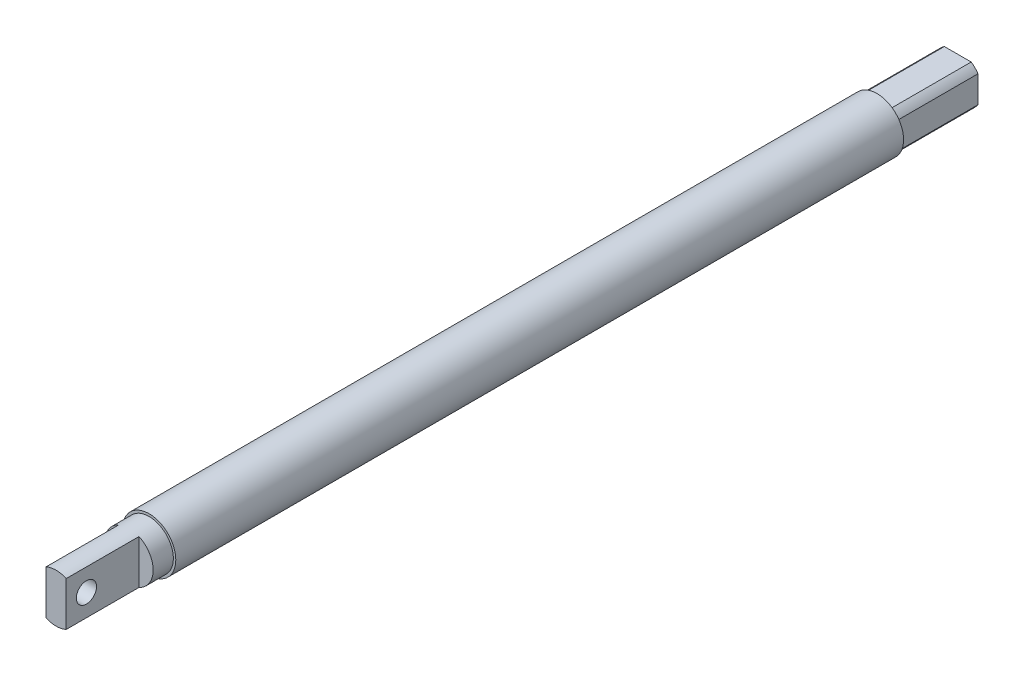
ISO-10303-21;
HEADER;
FILE_DESCRIPTION(('STEP AP214'),'2;1');
FILE_NAME('part.step','',(''),(''),'','','');
FILE_SCHEMA(('AUTOMOTIVE_DESIGN { 1 0 10303 214 1 1 1 1 }'));
ENDSEC;
DATA;
#1=APPLICATION_CONTEXT('core data for automotive mechanical design processes');
#2=APPLICATION_PROTOCOL_DEFINITION('international standard','automotive_design',2000,#1);
#3=PRODUCT_CONTEXT('',#1,'mechanical');
#4=PRODUCT('Part','Part','',(#3));
#5=PRODUCT_RELATED_PRODUCT_CATEGORY('part','',(#4));
#6=PRODUCT_DEFINITION_FORMATION('','',#4);
#7=PRODUCT_DEFINITION_CONTEXT('part definition',#1,'design');
#8=PRODUCT_DEFINITION('design','',#6,#7);
#9=PRODUCT_DEFINITION_SHAPE('','',#8);
#10=(LENGTH_UNIT() NAMED_UNIT(*) SI_UNIT(.MILLI.,.METRE.));
#11=(NAMED_UNIT(*) PLANE_ANGLE_UNIT() SI_UNIT($,.RADIAN.));
#12=(NAMED_UNIT(*) SI_UNIT($,.STERADIAN.) SOLID_ANGLE_UNIT());
#13=UNCERTAINTY_MEASURE_WITH_UNIT(LENGTH_MEASURE(1.E-05),#10,'distance_accuracy_value','');
#14=(GEOMETRIC_REPRESENTATION_CONTEXT(3) GLOBAL_UNCERTAINTY_ASSIGNED_CONTEXT((#13)) GLOBAL_UNIT_ASSIGNED_CONTEXT((#10,
#11,#12)) REPRESENTATION_CONTEXT('',''));
#15=CARTESIAN_POINT('',(0.,0.,0.));
#16=DIRECTION('',(0.,0.,1.));
#17=DIRECTION('',(1.,0.,0.));
#18=AXIS2_PLACEMENT_3D('',#15,#16,#17);
#19=CARTESIAN_POINT('',(0.,0.,254.));
#20=DIRECTION('',(0.,0.,-1.));
#21=DIRECTION('',(-1.,0.,0.));
#22=AXIS2_PLACEMENT_3D('',#19,#20,#21);
#23=CYLINDRICAL_SURFACE('',#22,6.985);
#24=CARTESIAN_POINT('',(0.,0.,25.4));
#25=DIRECTION('',(0.,0.,1.));
#26=DIRECTION('',(1.,0.,0.));
#27=AXIS2_PLACEMENT_3D('',#24,#25,#26);
#28=CIRCLE('',#27,6.985);
#29=CARTESIAN_POINT('',(0.,6.985,25.4));
#30=VERTEX_POINT('',#29);
#31=CARTESIAN_POINT('',(-2.90993556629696,6.35,25.4));
#32=VERTEX_POINT('',#31);
#33=EDGE_CURVE('E219',#30,#32,#28,.T.);
#34=ORIENTED_EDGE('',*,*,#33,.F.);
#35=DIRECTION('',(0.,0.,-1.));
#36=VECTOR('',#35,1.);
#37=CARTESIAN_POINT('',(0.,6.985,254.));
#38=LINE('',#37,#36);
#39=CARTESIAN_POINT('',(0.,6.985,254.));
#40=VERTEX_POINT('',#39);
#41=EDGE_CURVE('E12',#30,#40,#38,.F.);
#42=ORIENTED_EDGE('',*,*,#41,.T.);
#43=CARTESIAN_POINT('',(0.,0.,254.));
#44=DIRECTION('',(0.,0.,1.));
#45=DIRECTION('',(1.,0.,0.));
#46=AXIS2_PLACEMENT_3D('',#43,#44,#45);
#47=CIRCLE('',#46,6.985);
#48=CARTESIAN_POINT('',(6.985,0.,254.));
#49=VERTEX_POINT('',#48);
#50=EDGE_CURVE('E208',#40,#49,#47,.T.);
#51=ORIENTED_EDGE('',*,*,#50,.T.);
#52=DIRECTION('',(0.,0.,-1.));
#53=VECTOR('',#52,1.);
#54=CARTESIAN_POINT('',(6.985,0.,254.));
#55=LINE('',#54,#53);
#56=CARTESIAN_POINT('',(6.985,0.,25.4));
#57=VERTEX_POINT('',#56);
#58=EDGE_CURVE('E45',#49,#57,#55,.T.);
#59=ORIENTED_EDGE('',*,*,#58,.T.);
#60=CARTESIAN_POINT('',(6.35,-2.90993556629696,25.4));
#61=VERTEX_POINT('',#60);
#62=EDGE_CURVE('E379',#61,#57,#28,.T.);
#63=ORIENTED_EDGE('',*,*,#62,.F.);
#64=CARTESIAN_POINT('',(2.90993556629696,-6.35,25.4));
#65=VERTEX_POINT('',#64);
#66=EDGE_CURVE('E220',#65,#61,#28,.T.);
#67=ORIENTED_EDGE('',*,*,#66,.F.);
#68=CARTESIAN_POINT('',(-2.90993556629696,-6.35,25.4));
#69=VERTEX_POINT('',#68);
#70=EDGE_CURVE('E377',#69,#65,#28,.T.);
#71=ORIENTED_EDGE('',*,*,#70,.F.);
#72=CARTESIAN_POINT('',(-6.35,-2.90993556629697,25.4));
#73=VERTEX_POINT('',#72);
#74=EDGE_CURVE('E375',#73,#69,#28,.T.);
#75=ORIENTED_EDGE('',*,*,#74,.F.);
#76=CARTESIAN_POINT('',(-6.35,2.90993556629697,25.4));
#77=VERTEX_POINT('',#76);
#78=EDGE_CURVE('E373',#77,#73,#28,.T.);
#79=ORIENTED_EDGE('',*,*,#78,.F.);
#80=EDGE_CURVE('E307',#32,#77,#28,.T.);
#81=ORIENTED_EDGE('',*,*,#80,.F.);
#82=EDGE_LOOP('',(#34,#42,#51,#59,#63,#67,#71,#75,#79,#81));
#83=FACE_BOUND('',#82,.T.);
#84=ADVANCED_FACE('F35',(#83),#23,.F.);
#85=CARTESIAN_POINT('',(0.,0.,25.4));
#86=DIRECTION('',(0.,0.,-1.));
#87=DIRECTION('',(-1.,0.,0.));
#88=AXIS2_PLACEMENT_3D('',#85,#86,#87);
#89=CYLINDRICAL_SURFACE('',#88,3.175);
#90=CARTESIAN_POINT('',(0.,0.,0.));
#91=DIRECTION('',(0.,0.,1.));
#92=DIRECTION('',(1.,0.,0.));
#93=AXIS2_PLACEMENT_3D('',#90,#91,#92);
#94=CIRCLE('',#93,3.175);
#95=CARTESIAN_POINT('',(0.,3.175,0.));
#96=VERTEX_POINT('',#95);
#97=CARTESIAN_POINT('',(3.175,0.,0.));
#98=VERTEX_POINT('',#97);
#99=EDGE_CURVE('E224',#96,#98,#94,.T.);
#100=ORIENTED_EDGE('',*,*,#99,.F.);
#101=DIRECTION('',(0.,0.,-1.));
#102=VECTOR('',#101,1.);
#103=CARTESIAN_POINT('',(0.,3.175,25.4));
#104=LINE('',#103,#102);
#105=CARTESIAN_POINT('',(0.,3.175,25.4));
#106=VERTEX_POINT('',#105);
#107=EDGE_CURVE('E314',#96,#106,#104,.F.);
#108=ORIENTED_EDGE('',*,*,#107,.T.);
#109=CARTESIAN_POINT('',(0.,0.,25.4));
#110=DIRECTION('',(0.,0.,1.));
#111=DIRECTION('',(1.,0.,0.));
#112=AXIS2_PLACEMENT_3D('',#109,#110,#111);
#113=CIRCLE('',#112,3.175);
#114=CARTESIAN_POINT('',(3.175,0.,25.4));
#115=VERTEX_POINT('',#114);
#116=EDGE_CURVE('E231',#106,#115,#113,.T.);
#117=ORIENTED_EDGE('',*,*,#116,.T.);
#118=DIRECTION('',(0.,0.,-1.));
#119=VECTOR('',#118,1.);
#120=CARTESIAN_POINT('',(3.175,0.,25.4));
#121=LINE('',#120,#119);
#122=EDGE_CURVE('E39',#115,#98,#121,.T.);
#123=ORIENTED_EDGE('',*,*,#122,.T.);
#124=EDGE_LOOP('',(#100,#108,#117,#123));
#125=FACE_BOUND('',#124,.T.);
#126=ADVANCED_FACE('F330',(#125),#89,.F.);
#127=CARTESIAN_POINT('',(0.,0.,283.21));
#128=DIRECTION('',(0.,0.,-1.));
#129=DIRECTION('',(-1.,0.,0.));
#130=AXIS2_PLACEMENT_3D('',#127,#128,#129);
#131=CYLINDRICAL_SURFACE('',#130,7.62);
#132=CARTESIAN_POINT('',(0.,0.,254.));
#133=DIRECTION('',(0.,0.,1.));
#134=DIRECTION('',(1.,0.,0.));
#135=AXIS2_PLACEMENT_3D('',#132,#133,#134);
#136=CIRCLE('',#135,7.62);
#137=CARTESIAN_POINT('',(7.62,0.,254.));
#138=VERTEX_POINT('',#137);
#139=EDGE_CURVE('E204',#138,#138,#136,.T.);
#140=ORIENTED_EDGE('',*,*,#139,.T.);
#141=EDGE_LOOP('',(#140));
#142=FACE_BOUND('',#141,.T.);
#143=DIRECTION('',(0.,0.,-1.));
#144=VECTOR('',#143,1.);
#145=CARTESIAN_POINT('',(-3.17500000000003,6.92703219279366,283.21));
#146=LINE('',#145,#144);
#147=CARTESIAN_POINT('',(-3.17500000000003,6.92703219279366,283.21));
#148=VERTEX_POINT('',#147);
#149=CARTESIAN_POINT('',(-3.17500000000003,6.92703219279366,260.35));
#150=VERTEX_POINT('',#149);
#151=EDGE_CURVE('E185',#148,#150,#146,.T.);
#152=ORIENTED_EDGE('',*,*,#151,.F.);
#153=CARTESIAN_POINT('',(0.,0.,283.21));
#154=DIRECTION('',(0.,0.,1.));
#155=DIRECTION('',(1.,0.,0.));
#156=AXIS2_PLACEMENT_3D('',#153,#154,#155);
#157=CIRCLE('',#156,7.62);
#158=CARTESIAN_POINT('',(3.17500000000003,6.92703219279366,283.21));
#159=VERTEX_POINT('',#158);
#160=EDGE_CURVE('E205',#159,#148,#157,.T.);
#161=ORIENTED_EDGE('',*,*,#160,.F.);
#162=DIRECTION('',(0.,0.,-1.));
#163=VECTOR('',#162,1.);
#164=CARTESIAN_POINT('',(3.17500000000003,6.92703219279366,283.21));
#165=LINE('',#164,#163);
#166=CARTESIAN_POINT('',(3.17500000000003,6.92703219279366,260.35));
#167=VERTEX_POINT('',#166);
#168=EDGE_CURVE('E201',#159,#167,#165,.T.);
#169=ORIENTED_EDGE('',*,*,#168,.T.);
#170=CARTESIAN_POINT('',(0.,0.,260.35));
#171=DIRECTION('',(0.,0.,-1.));
#172=DIRECTION('',(-1.,0.,0.));
#173=AXIS2_PLACEMENT_3D('',#170,#171,#172);
#174=CIRCLE('',#173,7.62);
#175=CARTESIAN_POINT('',(3.17500000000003,-6.92703219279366,260.35));
#176=VERTEX_POINT('',#175);
#177=EDGE_CURVE('E306',#167,#176,#174,.T.);
#178=ORIENTED_EDGE('',*,*,#177,.T.);
#179=DIRECTION('',(0.,0.,-1.));
#180=VECTOR('',#179,1.);
#181=CARTESIAN_POINT('',(3.17500000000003,-6.92703219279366,283.21));
#182=LINE('',#181,#180);
#183=CARTESIAN_POINT('',(3.17500000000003,-6.92703219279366,283.21));
#184=VERTEX_POINT('',#183);
#185=EDGE_CURVE('E199',#176,#184,#182,.F.);
#186=ORIENTED_EDGE('',*,*,#185,.T.);
#187=CARTESIAN_POINT('',(-3.17500000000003,-6.92703219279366,283.21));
#188=VERTEX_POINT('',#187);
#189=EDGE_CURVE('E191',#188,#184,#157,.T.);
#190=ORIENTED_EDGE('',*,*,#189,.F.);
#191=DIRECTION('',(0.,0.,-1.));
#192=VECTOR('',#191,1.);
#193=CARTESIAN_POINT('',(-3.17500000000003,-6.92703219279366,283.21));
#194=LINE('',#193,#192);
#195=CARTESIAN_POINT('',(-3.17500000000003,-6.92703219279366,260.35));
#196=VERTEX_POINT('',#195);
#197=EDGE_CURVE('E183',#196,#188,#194,.F.);
#198=ORIENTED_EDGE('',*,*,#197,.F.);
#199=CARTESIAN_POINT('',(0.,0.,260.35));
#200=DIRECTION('',(0.,0.,1.));
#201=DIRECTION('',(1.,0.,0.));
#202=AXIS2_PLACEMENT_3D('',#199,#200,#201);
#203=CIRCLE('',#202,7.62);
#204=EDGE_CURVE('E172',#150,#196,#203,.T.);
#205=ORIENTED_EDGE('',*,*,#204,.F.);
#206=EDGE_LOOP('',(#152,#161,#169,#178,#186,#190,#198,#205));
#207=FACE_BOUND('',#206,.T.);
#208=ADVANCED_FACE('F189',(#142,#207),#131,.T.);
#209=CARTESIAN_POINT('',(0.,0.,283.21));
#210=DIRECTION('',(0.,0.,1.));
#211=DIRECTION('',(1.,0.,0.));
#212=AXIS2_PLACEMENT_3D('',#209,#210,#211);
#213=PLANE('',#212);
#214=ORIENTED_EDGE('',*,*,#160,.T.);
#215=DIRECTION('',(0.,-1.,0.));
#216=VECTOR('',#215,1.);
#217=CARTESIAN_POINT('',(-3.17500000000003,0.,283.21));
#218=LINE('',#217,#216);
#219=EDGE_CURVE('E179',#148,#188,#218,.T.);
#220=ORIENTED_EDGE('',*,*,#219,.T.);
#221=ORIENTED_EDGE('',*,*,#189,.T.);
#222=DIRECTION('',(0.,-1.,0.));
#223=VECTOR('',#222,1.);
#224=CARTESIAN_POINT('',(3.17500000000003,0.,283.21));
#225=LINE('',#224,#223);
#226=EDGE_CURVE('E303',#159,#184,#225,.T.);
#227=ORIENTED_EDGE('',*,*,#226,.F.);
#228=EDGE_LOOP('',(#214,#220,#221,#227));
#229=FACE_BOUND('',#228,.T.);
#230=ADVANCED_FACE('F596',(#229),#213,.T.);
#231=CARTESIAN_POINT('',(0.,0.,254.));
#232=DIRECTION('',(0.,0.,1.));
#233=DIRECTION('',(1.,0.,0.));
#234=AXIS2_PLACEMENT_3D('',#231,#232,#233);
#235=PLANE('',#234);
#236=CARTESIAN_POINT('',(0.,0.,254.));
#237=DIRECTION('',(0.,0.,1.));
#238=DIRECTION('',(1.,0.,0.));
#239=AXIS2_PLACEMENT_3D('',#236,#237,#238);
#240=CIRCLE('',#239,8.382);
#241=CARTESIAN_POINT('',(8.382,0.,254.));
#242=VERTEX_POINT('',#241);
#243=EDGE_CURVE('E221',#242,#242,#240,.T.);
#244=ORIENTED_EDGE('',*,*,#243,.T.);
#245=EDGE_LOOP('',(#244));
#246=FACE_BOUND('',#245,.T.);
#247=ORIENTED_EDGE('',*,*,#139,.F.);
#248=EDGE_LOOP('',(#247));
#249=FACE_BOUND('',#248,.T.);
#250=ADVANCED_FACE('F342',(#246,#249),#235,.T.);
#251=CARTESIAN_POINT('',(0.,0.,25.4));
#252=DIRECTION('',(0.,0.,1.));
#253=DIRECTION('',(1.,0.,0.));
#254=AXIS2_PLACEMENT_3D('',#251,#252,#253);
#255=PLANE('',#254);
#256=EDGE_CURVE('E227',#115,#106,#113,.T.);
#257=ORIENTED_EDGE('',*,*,#256,.F.);
#258=ORIENTED_EDGE('',*,*,#116,.F.);
#259=EDGE_LOOP('',(#257,#258));
#260=FACE_BOUND('',#259,.T.);
#261=DIRECTION('',(0.,1.,0.));
#262=VECTOR('',#261,1.);
#263=CARTESIAN_POINT('',(6.35,4.21211348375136,25.4));
#264=LINE('',#263,#262);
#265=CARTESIAN_POINT('',(6.35,2.90993556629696,25.4));
#266=VERTEX_POINT('',#265);
#267=EDGE_CURVE('E250',#61,#266,#264,.T.);
#268=ORIENTED_EDGE('',*,*,#267,.T.);
#269=CARTESIAN_POINT('',(2.90993556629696,6.35,25.4));
#270=VERTEX_POINT('',#269);
#271=EDGE_CURVE('E214',#266,#270,#28,.T.);
#272=ORIENTED_EDGE('',*,*,#271,.T.);
#273=DIRECTION('',(-1.,0.,0.));
#274=VECTOR('',#273,1.);
#275=CARTESIAN_POINT('',(-4.21211348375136,6.35,25.4));
#276=LINE('',#275,#274);
#277=EDGE_CURVE('E257',#270,#32,#276,.T.);
#278=ORIENTED_EDGE('',*,*,#277,.T.);
#279=ORIENTED_EDGE('',*,*,#80,.T.);
#280=DIRECTION('',(0.,-1.,0.));
#281=VECTOR('',#280,1.);
#282=CARTESIAN_POINT('',(-6.35,4.21211348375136,25.4));
#283=LINE('',#282,#281);
#284=EDGE_CURVE('E264',#77,#73,#283,.T.);
#285=ORIENTED_EDGE('',*,*,#284,.T.);
#286=ORIENTED_EDGE('',*,*,#74,.T.);
#287=DIRECTION('',(1.,0.,0.));
#288=VECTOR('',#287,1.);
#289=CARTESIAN_POINT('',(-4.21211348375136,-6.35,25.4));
#290=LINE('',#289,#288);
#291=EDGE_CURVE('E243',#69,#65,#290,.T.);
#292=ORIENTED_EDGE('',*,*,#291,.T.);
#293=ORIENTED_EDGE('',*,*,#66,.T.);
#294=EDGE_LOOP('',(#268,#272,#278,#279,#285,#286,#292,#293));
#295=FACE_BOUND('',#294,.T.);
#296=ADVANCED_FACE('F339',(#260,#295),#255,.T.);
#297=CARTESIAN_POINT('',(0.,0.,0.));
#298=DIRECTION('',(0.,0.,1.));
#299=DIRECTION('',(1.,0.,0.));
#300=AXIS2_PLACEMENT_3D('',#297,#298,#299);
#301=PLANE('',#300);
#302=CARTESIAN_POINT('',(0.,0.,0.));
#303=DIRECTION('',(0.,0.,1.));
#304=DIRECTION('',(1.,0.,0.));
#305=AXIS2_PLACEMENT_3D('',#302,#303,#304);
#306=CIRCLE('',#305,7.62);
#307=CARTESIAN_POINT('',(-6.35,-4.21211348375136,0.));
#308=VERTEX_POINT('',#307);
#309=CARTESIAN_POINT('',(-4.21211348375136,-6.35,0.));
#310=VERTEX_POINT('',#309);
#311=EDGE_CURVE('E230',#308,#310,#306,.T.);
#312=ORIENTED_EDGE('',*,*,#311,.F.);
#313=DIRECTION('',(0.,-1.,0.));
#314=VECTOR('',#313,1.);
#315=CARTESIAN_POINT('',(-6.35,4.21211348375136,0.));
#316=LINE('',#315,#314);
#317=CARTESIAN_POINT('',(-6.35,4.21211348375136,0.));
#318=VERTEX_POINT('',#317);
#319=EDGE_CURVE('E238',#318,#308,#316,.T.);
#320=ORIENTED_EDGE('',*,*,#319,.F.);
#321=CARTESIAN_POINT('',(0.,0.,0.));
#322=DIRECTION('',(0.,0.,1.));
#323=DIRECTION('',(1.,0.,0.));
#324=AXIS2_PLACEMENT_3D('',#321,#322,#323);
#325=CIRCLE('',#324,7.62);
#326=CARTESIAN_POINT('',(-4.21211348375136,6.35,0.));
#327=VERTEX_POINT('',#326);
#328=EDGE_CURVE('E277',#327,#318,#325,.T.);
#329=ORIENTED_EDGE('',*,*,#328,.F.);
#330=DIRECTION('',(-1.,0.,0.));
#331=VECTOR('',#330,1.);
#332=CARTESIAN_POINT('',(-4.21211348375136,6.35,0.));
#333=LINE('',#332,#331);
#334=CARTESIAN_POINT('',(4.21211348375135,6.35,0.));
#335=VERTEX_POINT('',#334);
#336=EDGE_CURVE('E275',#335,#327,#333,.T.);
#337=ORIENTED_EDGE('',*,*,#336,.F.);
#338=CARTESIAN_POINT('',(0.,0.,0.));
#339=DIRECTION('',(0.,0.,1.));
#340=DIRECTION('',(1.,0.,0.));
#341=AXIS2_PLACEMENT_3D('',#338,#339,#340);
#342=CIRCLE('',#341,7.62);
#343=CARTESIAN_POINT('',(6.35,4.21211348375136,0.));
#344=VERTEX_POINT('',#343);
#345=EDGE_CURVE('E273',#344,#335,#342,.T.);
#346=ORIENTED_EDGE('',*,*,#345,.F.);
#347=DIRECTION('',(0.,1.,0.));
#348=VECTOR('',#347,1.);
#349=CARTESIAN_POINT('',(6.35,4.21211348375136,0.));
#350=LINE('',#349,#348);
#351=CARTESIAN_POINT('',(6.35,-4.21211348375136,0.));
#352=VERTEX_POINT('',#351);
#353=EDGE_CURVE('E271',#352,#344,#350,.T.);
#354=ORIENTED_EDGE('',*,*,#353,.F.);
#355=CARTESIAN_POINT('',(0.,0.,0.));
#356=DIRECTION('',(0.,0.,1.));
#357=DIRECTION('',(1.,0.,0.));
#358=AXIS2_PLACEMENT_3D('',#355,#356,#357);
#359=CIRCLE('',#358,7.62);
#360=CARTESIAN_POINT('',(4.21211348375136,-6.35,0.));
#361=VERTEX_POINT('',#360);
#362=EDGE_CURVE('E269',#361,#352,#359,.T.);
#363=ORIENTED_EDGE('',*,*,#362,.F.);
#364=DIRECTION('',(1.,0.,0.));
#365=VECTOR('',#364,1.);
#366=CARTESIAN_POINT('',(-4.21211348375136,-6.35,0.));
#367=LINE('',#366,#365);
#368=EDGE_CURVE('E267',#310,#361,#367,.T.);
#369=ORIENTED_EDGE('',*,*,#368,.F.);
#370=EDGE_LOOP('',(#312,#320,#329,#337,#346,#354,#363,#369));
#371=FACE_BOUND('',#370,.T.);
#372=EDGE_CURVE('E232',#98,#96,#94,.T.);
#373=ORIENTED_EDGE('',*,*,#372,.T.);
#374=ORIENTED_EDGE('',*,*,#99,.T.);
#375=EDGE_LOOP('',(#373,#374));
#376=FACE_BOUND('',#375,.T.);
#377=ADVANCED_FACE('F336',(#371,#376),#301,.F.);
#378=CARTESIAN_POINT('',(0.,0.,25.4));
#379=DIRECTION('',(0.,0.,-1.));
#380=DIRECTION('',(-1.,0.,0.));
#381=AXIS2_PLACEMENT_3D('',#378,#379,#380);
#382=CYLINDRICAL_SURFACE('',#381,7.62);
#383=ORIENTED_EDGE('',*,*,#311,.T.);
#384=DIRECTION('',(0.,0.,-1.));
#385=VECTOR('',#384,1.);
#386=CARTESIAN_POINT('',(-4.21211348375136,-6.35,25.4));
#387=LINE('',#386,#385);
#388=CARTESIAN_POINT('',(-4.21211348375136,-6.35,25.4));
#389=VERTEX_POINT('',#388);
#390=EDGE_CURVE('E300',#389,#310,#387,.T.);
#391=ORIENTED_EDGE('',*,*,#390,.F.);
#392=CARTESIAN_POINT('',(0.,0.,25.4));
#393=DIRECTION('',(0.,0.,1.));
#394=DIRECTION('',(1.,0.,0.));
#395=AXIS2_PLACEMENT_3D('',#392,#393,#394);
#396=CIRCLE('',#395,7.62);
#397=CARTESIAN_POINT('',(-6.35,-4.21211348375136,25.4));
#398=VERTEX_POINT('',#397);
#399=EDGE_CURVE('E235',#398,#389,#396,.T.);
#400=ORIENTED_EDGE('',*,*,#399,.F.);
#401=DIRECTION('',(0.,0.,-1.));
#402=VECTOR('',#401,1.);
#403=CARTESIAN_POINT('',(-6.35,-4.21211348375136,25.4));
#404=LINE('',#403,#402);
#405=EDGE_CURVE('E263',#398,#308,#404,.T.);
#406=ORIENTED_EDGE('',*,*,#405,.T.);
#407=EDGE_LOOP('',(#383,#391,#400,#406));
#408=FACE_BOUND('',#407,.T.);
#409=ADVANCED_FACE('F37',(#408),#382,.T.);
#410=CARTESIAN_POINT('',(-4.21211348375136,-6.35,25.4));
#411=DIRECTION('',(0.,1.,0.));
#412=DIRECTION('',(-1.,0.,0.));
#413=AXIS2_PLACEMENT_3D('',#410,#411,#412);
#414=PLANE('',#413);
#415=ORIENTED_EDGE('',*,*,#368,.T.);
#416=DIRECTION('',(0.,0.,-1.));
#417=VECTOR('',#416,1.);
#418=CARTESIAN_POINT('',(4.21211348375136,-6.35,25.4));
#419=LINE('',#418,#417);
#420=CARTESIAN_POINT('',(4.21211348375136,-6.35,25.4));
#421=VERTEX_POINT('',#420);
#422=EDGE_CURVE('E297',#421,#361,#419,.T.);
#423=ORIENTED_EDGE('',*,*,#422,.F.);
#424=EDGE_CURVE('E237',#65,#421,#290,.T.);
#425=ORIENTED_EDGE('',*,*,#424,.F.);
#426=ORIENTED_EDGE('',*,*,#291,.F.);
#427=EDGE_CURVE('E239',#389,#69,#290,.T.);
#428=ORIENTED_EDGE('',*,*,#427,.F.);
#429=ORIENTED_EDGE('',*,*,#390,.T.);
#430=EDGE_LOOP('',(#415,#423,#425,#426,#428,#429));
#431=FACE_BOUND('',#430,.T.);
#432=ADVANCED_FACE('F387',(#431),#414,.F.);
#433=CARTESIAN_POINT('',(0.,0.,25.4));
#434=DIRECTION('',(0.,0.,-1.));
#435=DIRECTION('',(-1.,0.,0.));
#436=AXIS2_PLACEMENT_3D('',#433,#434,#435);
#437=CYLINDRICAL_SURFACE('',#436,7.62);
#438=ORIENTED_EDGE('',*,*,#362,.T.);
#439=DIRECTION('',(0.,0.,-1.));
#440=VECTOR('',#439,1.);
#441=CARTESIAN_POINT('',(6.35,-4.21211348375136,25.4));
#442=LINE('',#441,#440);
#443=CARTESIAN_POINT('',(6.35,-4.21211348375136,25.4));
#444=VERTEX_POINT('',#443);
#445=EDGE_CURVE('E294',#444,#352,#442,.T.);
#446=ORIENTED_EDGE('',*,*,#445,.F.);
#447=CARTESIAN_POINT('',(0.,0.,25.4));
#448=DIRECTION('',(0.,0.,1.));
#449=DIRECTION('',(1.,0.,0.));
#450=AXIS2_PLACEMENT_3D('',#447,#448,#449);
#451=CIRCLE('',#450,7.62);
#452=EDGE_CURVE('E242',#421,#444,#451,.T.);
#453=ORIENTED_EDGE('',*,*,#452,.F.);
#454=ORIENTED_EDGE('',*,*,#422,.T.);
#455=EDGE_LOOP('',(#438,#446,#453,#454));
#456=FACE_BOUND('',#455,.T.);
#457=ADVANCED_FACE('F394',(#456),#437,.T.);
#458=CARTESIAN_POINT('',(6.35,4.21211348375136,25.4));
#459=DIRECTION('',(-1.,0.,0.));
#460=DIRECTION('',(0.,-1.,0.));
#461=AXIS2_PLACEMENT_3D('',#458,#459,#460);
#462=PLANE('',#461);
#463=ORIENTED_EDGE('',*,*,#353,.T.);
#464=DIRECTION('',(0.,0.,-1.));
#465=VECTOR('',#464,1.);
#466=CARTESIAN_POINT('',(6.35,4.21211348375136,25.4));
#467=LINE('',#466,#465);
#468=CARTESIAN_POINT('',(6.35,4.21211348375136,25.4));
#469=VERTEX_POINT('',#468);
#470=EDGE_CURVE('E291',#469,#344,#467,.T.);
#471=ORIENTED_EDGE('',*,*,#470,.F.);
#472=EDGE_CURVE('E245',#266,#469,#264,.T.);
#473=ORIENTED_EDGE('',*,*,#472,.F.);
#474=ORIENTED_EDGE('',*,*,#267,.F.);
#475=EDGE_CURVE('E246',#444,#61,#264,.T.);
#476=ORIENTED_EDGE('',*,*,#475,.F.);
#477=ORIENTED_EDGE('',*,*,#445,.T.);
#478=EDGE_LOOP('',(#463,#471,#473,#474,#476,#477));
#479=FACE_BOUND('',#478,.T.);
#480=ADVANCED_FACE('F361',(#479),#462,.F.);
#481=CARTESIAN_POINT('',(0.,0.,25.4));
#482=DIRECTION('',(0.,0.,-1.));
#483=DIRECTION('',(-1.,0.,0.));
#484=AXIS2_PLACEMENT_3D('',#481,#482,#483);
#485=CYLINDRICAL_SURFACE('',#484,7.62);
#486=ORIENTED_EDGE('',*,*,#345,.T.);
#487=DIRECTION('',(0.,0.,-1.));
#488=VECTOR('',#487,1.);
#489=CARTESIAN_POINT('',(4.21211348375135,6.35,25.4));
#490=LINE('',#489,#488);
#491=CARTESIAN_POINT('',(4.21211348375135,6.35,25.4));
#492=VERTEX_POINT('',#491);
#493=EDGE_CURVE('E288',#492,#335,#490,.T.);
#494=ORIENTED_EDGE('',*,*,#493,.F.);
#495=CARTESIAN_POINT('',(0.,0.,25.4));
#496=DIRECTION('',(0.,0.,1.));
#497=DIRECTION('',(1.,0.,0.));
#498=AXIS2_PLACEMENT_3D('',#495,#496,#497);
#499=CIRCLE('',#498,7.62);
#500=EDGE_CURVE('E249',#469,#492,#499,.T.);
#501=ORIENTED_EDGE('',*,*,#500,.F.);
#502=ORIENTED_EDGE('',*,*,#470,.T.);
#503=EDGE_LOOP('',(#486,#494,#501,#502));
#504=FACE_BOUND('',#503,.T.);
#505=ADVANCED_FACE('F365',(#504),#485,.T.);
#506=CARTESIAN_POINT('',(-4.21211348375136,6.35,25.4));
#507=DIRECTION('',(0.,-1.,0.));
#508=DIRECTION('',(1.,0.,0.));
#509=AXIS2_PLACEMENT_3D('',#506,#507,#508);
#510=PLANE('',#509);
#511=ORIENTED_EDGE('',*,*,#336,.T.);
#512=DIRECTION('',(0.,0.,-1.));
#513=VECTOR('',#512,1.);
#514=CARTESIAN_POINT('',(-4.21211348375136,6.35,25.4));
#515=LINE('',#514,#513);
#516=CARTESIAN_POINT('',(-4.21211348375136,6.35,25.4));
#517=VERTEX_POINT('',#516);
#518=EDGE_CURVE('E285',#517,#327,#515,.T.);
#519=ORIENTED_EDGE('',*,*,#518,.F.);
#520=EDGE_CURVE('E252',#32,#517,#276,.T.);
#521=ORIENTED_EDGE('',*,*,#520,.F.);
#522=ORIENTED_EDGE('',*,*,#277,.F.);
#523=EDGE_CURVE('E253',#492,#270,#276,.T.);
#524=ORIENTED_EDGE('',*,*,#523,.F.);
#525=ORIENTED_EDGE('',*,*,#493,.T.);
#526=EDGE_LOOP('',(#511,#519,#521,#522,#524,#525));
#527=FACE_BOUND('',#526,.T.);
#528=ADVANCED_FACE('F369',(#527),#510,.F.);
#529=CARTESIAN_POINT('',(0.,0.,25.4));
#530=DIRECTION('',(0.,0.,-1.));
#531=DIRECTION('',(-1.,0.,0.));
#532=AXIS2_PLACEMENT_3D('',#529,#530,#531);
#533=CYLINDRICAL_SURFACE('',#532,7.62);
#534=ORIENTED_EDGE('',*,*,#328,.T.);
#535=DIRECTION('',(0.,0.,-1.));
#536=VECTOR('',#535,1.);
#537=CARTESIAN_POINT('',(-6.35,4.21211348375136,25.4));
#538=LINE('',#537,#536);
#539=CARTESIAN_POINT('',(-6.35,4.21211348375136,25.4));
#540=VERTEX_POINT('',#539);
#541=EDGE_CURVE('E282',#540,#318,#538,.T.);
#542=ORIENTED_EDGE('',*,*,#541,.F.);
#543=CARTESIAN_POINT('',(0.,0.,25.4));
#544=DIRECTION('',(0.,0.,1.));
#545=DIRECTION('',(1.,0.,0.));
#546=AXIS2_PLACEMENT_3D('',#543,#544,#545);
#547=CIRCLE('',#546,7.62);
#548=EDGE_CURVE('E256',#517,#540,#547,.T.);
#549=ORIENTED_EDGE('',*,*,#548,.F.);
#550=ORIENTED_EDGE('',*,*,#518,.T.);
#551=EDGE_LOOP('',(#534,#542,#549,#550));
#552=FACE_BOUND('',#551,.T.);
#553=ADVANCED_FACE('F402',(#552),#533,.T.);
#554=CARTESIAN_POINT('',(-6.35,4.21211348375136,25.4));
#555=DIRECTION('',(1.,0.,0.));
#556=DIRECTION('',(0.,0.,-1.));
#557=AXIS2_PLACEMENT_3D('',#554,#555,#556);
#558=PLANE('',#557);
#559=ORIENTED_EDGE('',*,*,#319,.T.);
#560=ORIENTED_EDGE('',*,*,#405,.F.);
#561=EDGE_CURVE('E259',#73,#398,#283,.T.);
#562=ORIENTED_EDGE('',*,*,#561,.F.);
#563=ORIENTED_EDGE('',*,*,#284,.F.);
#564=EDGE_CURVE('E260',#540,#77,#283,.T.);
#565=ORIENTED_EDGE('',*,*,#564,.F.);
#566=ORIENTED_EDGE('',*,*,#541,.T.);
#567=EDGE_LOOP('',(#559,#560,#562,#563,#565,#566));
#568=FACE_BOUND('',#567,.T.);
#569=ADVANCED_FACE('F406',(#568),#558,.F.);
#570=ORIENTED_EDGE('',*,*,#107,.F.);
#571=ORIENTED_EDGE('',*,*,#372,.F.);
#572=ORIENTED_EDGE('',*,*,#122,.F.);
#573=ORIENTED_EDGE('',*,*,#256,.T.);
#574=EDGE_LOOP('',(#570,#571,#572,#573));
#575=FACE_BOUND('',#574,.T.);
#576=ADVANCED_FACE('F337',(#575),#89,.F.);
#577=CARTESIAN_POINT('',(0.,0.,25.4));
#578=DIRECTION('',(0.,0.,1.));
#579=DIRECTION('',(1.,0.,0.));
#580=AXIS2_PLACEMENT_3D('',#577,#578,#579);
#581=PLANE('',#580);
#582=CARTESIAN_POINT('',(0.,0.,25.4));
#583=DIRECTION('',(0.,0.,1.));
#584=DIRECTION('',(1.,0.,0.));
#585=AXIS2_PLACEMENT_3D('',#582,#583,#584);
#586=CIRCLE('',#585,8.382);
#587=CARTESIAN_POINT('',(8.382,0.,25.4));
#588=VERTEX_POINT('',#587);
#589=EDGE_CURVE('E217',#588,#588,#586,.T.);
#590=ORIENTED_EDGE('',*,*,#589,.F.);
#591=EDGE_LOOP('',(#590));
#592=FACE_BOUND('',#591,.T.);
#593=ORIENTED_EDGE('',*,*,#70,.T.);
#594=ORIENTED_EDGE('',*,*,#424,.T.);
#595=ORIENTED_EDGE('',*,*,#452,.T.);
#596=ORIENTED_EDGE('',*,*,#475,.T.);
#597=ORIENTED_EDGE('',*,*,#62,.T.);
#598=EDGE_CURVE('E213',#57,#266,#28,.T.);
#599=ORIENTED_EDGE('',*,*,#598,.T.);
#600=ORIENTED_EDGE('',*,*,#472,.T.);
#601=ORIENTED_EDGE('',*,*,#500,.T.);
#602=ORIENTED_EDGE('',*,*,#523,.T.);
#603=EDGE_CURVE('E218',#270,#30,#28,.T.);
#604=ORIENTED_EDGE('',*,*,#603,.T.);
#605=ORIENTED_EDGE('',*,*,#33,.T.);
#606=ORIENTED_EDGE('',*,*,#520,.T.);
#607=ORIENTED_EDGE('',*,*,#548,.T.);
#608=ORIENTED_EDGE('',*,*,#564,.T.);
#609=ORIENTED_EDGE('',*,*,#78,.T.);
#610=ORIENTED_EDGE('',*,*,#561,.T.);
#611=ORIENTED_EDGE('',*,*,#399,.T.);
#612=ORIENTED_EDGE('',*,*,#427,.T.);
#613=EDGE_LOOP('',(#593,#594,#595,#596,#597,#599,#600,#601,#602,#604,#605,#606,#607,#608,#609,
#610,#611,#612));
#614=FACE_BOUND('',#613,.T.);
#615=ADVANCED_FACE('F357',(#592,#614),#581,.F.);
#616=CARTESIAN_POINT('',(0.,0.,254.));
#617=DIRECTION('',(0.,0.,-1.));
#618=DIRECTION('',(-1.,0.,0.));
#619=AXIS2_PLACEMENT_3D('',#616,#617,#618);
#620=CYLINDRICAL_SURFACE('',#619,8.382);
#621=ORIENTED_EDGE('',*,*,#243,.F.);
#622=EDGE_LOOP('',(#621));
#623=FACE_BOUND('',#622,.T.);
#624=ORIENTED_EDGE('',*,*,#589,.T.);
#625=EDGE_LOOP('',(#624));
#626=FACE_BOUND('',#625,.T.);
#627=ADVANCED_FACE('F427',(#623,#626),#620,.T.);
#628=ORIENTED_EDGE('',*,*,#41,.F.);
#629=ORIENTED_EDGE('',*,*,#603,.F.);
#630=ORIENTED_EDGE('',*,*,#271,.F.);
#631=ORIENTED_EDGE('',*,*,#598,.F.);
#632=ORIENTED_EDGE('',*,*,#58,.F.);
#633=EDGE_CURVE('E211',#49,#40,#47,.T.);
#634=ORIENTED_EDGE('',*,*,#633,.T.);
#635=EDGE_LOOP('',(#628,#629,#630,#631,#632,#634));
#636=FACE_BOUND('',#635,.T.);
#637=ADVANCED_FACE('F418',(#636),#23,.F.);
#638=CARTESIAN_POINT('',(0.,0.,254.));
#639=DIRECTION('',(0.,0.,1.));
#640=DIRECTION('',(1.,0.,0.));
#641=AXIS2_PLACEMENT_3D('',#638,#639,#640);
#642=PLANE('',#641);
#643=ORIENTED_EDGE('',*,*,#633,.F.);
#644=ORIENTED_EDGE('',*,*,#50,.F.);
#645=EDGE_LOOP('',(#643,#644));
#646=FACE_BOUND('',#645,.T.);
#647=ADVANCED_FACE('F426',(#646),#642,.F.);
#648=CARTESIAN_POINT('',(3.17500000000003,-8.382,260.35));
#649=DIRECTION('',(0.,0.,-1.));
#650=DIRECTION('',(-1.,0.,0.));
#651=AXIS2_PLACEMENT_3D('',#648,#649,#650);
#652=PLANE('',#651);
#653=DIRECTION('',(0.,1.,0.));
#654=VECTOR('',#653,1.);
#655=CARTESIAN_POINT('',(3.17500000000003,-8.382,260.35));
#656=LINE('',#655,#654);
#657=EDGE_CURVE('E193',#176,#167,#656,.T.);
#658=ORIENTED_EDGE('',*,*,#657,.F.);
#659=ORIENTED_EDGE('',*,*,#177,.F.);
#660=EDGE_LOOP('',(#658,#659));
#661=FACE_BOUND('',#660,.T.);
#662=ADVANCED_FACE('F432',(#661),#652,.F.);
#663=CARTESIAN_POINT('',(3.17500000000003,-8.382,260.35));
#664=DIRECTION('',(-1.,0.,0.));
#665=DIRECTION('',(0.,0.,1.));
#666=AXIS2_PLACEMENT_3D('',#663,#664,#665);
#667=PLANE('',#666);
#668=CARTESIAN_POINT('',(3.17500000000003,0.,276.86));
#669=DIRECTION('',(-1.,0.,0.));
#670=DIRECTION('',(0.,0.,1.));
#671=AXIS2_PLACEMENT_3D('',#668,#669,#670);
#672=CIRCLE('',#671,3.17499999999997);
#673=CARTESIAN_POINT('',(3.17500000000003,0.,280.035));
#674=VERTEX_POINT('',#673);
#675=EDGE_CURVE('E186',#674,#674,#672,.T.);
#676=ORIENTED_EDGE('',*,*,#675,.T.);
#677=EDGE_LOOP('',(#676));
#678=FACE_BOUND('',#677,.T.);
#679=ORIENTED_EDGE('',*,*,#226,.T.);
#680=ORIENTED_EDGE('',*,*,#185,.F.);
#681=ORIENTED_EDGE('',*,*,#657,.T.);
#682=ORIENTED_EDGE('',*,*,#168,.F.);
#683=EDGE_LOOP('',(#679,#680,#681,#682));
#684=FACE_BOUND('',#683,.T.);
#685=ADVANCED_FACE('F513',(#678,#684),#667,.F.);
#686=CARTESIAN_POINT('',(-3.17500000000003,-8.382,260.35));
#687=DIRECTION('',(0.,0.,1.));
#688=DIRECTION('',(1.,0.,0.));
#689=AXIS2_PLACEMENT_3D('',#686,#687,#688);
#690=PLANE('',#689);
#691=ORIENTED_EDGE('',*,*,#204,.T.);
#692=DIRECTION('',(0.,1.,0.));
#693=VECTOR('',#692,1.);
#694=CARTESIAN_POINT('',(-3.17500000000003,-8.382,260.35));
#695=LINE('',#694,#693);
#696=EDGE_CURVE('E175',#196,#150,#695,.T.);
#697=ORIENTED_EDGE('',*,*,#696,.T.);
#698=EDGE_LOOP('',(#691,#697));
#699=FACE_BOUND('',#698,.T.);
#700=ADVANCED_FACE('F174',(#699),#690,.T.);
#701=CARTESIAN_POINT('',(-3.17500000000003,-8.382,260.35));
#702=DIRECTION('',(-1.,0.,0.));
#703=DIRECTION('',(0.,0.,1.));
#704=AXIS2_PLACEMENT_3D('',#701,#702,#703);
#705=PLANE('',#704);
#706=CARTESIAN_POINT('',(-3.17500000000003,0.,276.86));
#707=DIRECTION('',(-1.,0.,0.));
#708=DIRECTION('',(0.,0.,1.));
#709=AXIS2_PLACEMENT_3D('',#706,#707,#708);
#710=CIRCLE('',#709,3.17499999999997);
#711=CARTESIAN_POINT('',(-3.17500000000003,0.,280.035));
#712=VERTEX_POINT('',#711);
#713=EDGE_CURVE('E311',#712,#712,#710,.T.);
#714=ORIENTED_EDGE('',*,*,#713,.F.);
#715=EDGE_LOOP('',(#714));
#716=FACE_BOUND('',#715,.T.);
#717=ORIENTED_EDGE('',*,*,#151,.T.);
#718=ORIENTED_EDGE('',*,*,#696,.F.);
#719=ORIENTED_EDGE('',*,*,#197,.T.);
#720=ORIENTED_EDGE('',*,*,#219,.F.);
#721=EDGE_LOOP('',(#717,#718,#719,#720));
#722=FACE_BOUND('',#721,.T.);
#723=ADVANCED_FACE('F182',(#716,#722),#705,.T.);
#724=CARTESIAN_POINT('',(-8.382,0.,276.86));
#725=DIRECTION('',(1.,0.,0.));
#726=DIRECTION('',(0.,0.,-1.));
#727=AXIS2_PLACEMENT_3D('',#724,#725,#726);
#728=CYLINDRICAL_SURFACE('',#727,3.17499999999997);
#729=ORIENTED_EDGE('',*,*,#713,.T.);
#730=EDGE_LOOP('',(#729));
#731=FACE_BOUND('',#730,.T.);
#732=ORIENTED_EDGE('',*,*,#675,.F.);
#733=EDGE_LOOP('',(#732));
#734=FACE_BOUND('',#733,.T.);
#735=ADVANCED_FACE('F536',(#731,#734),#728,.F.);
#736=CLOSED_SHELL('',(#84,#126,#208,#230,#250,#296,#377,#409,#432,#457,#480,#505,#528,#553,#569,
#576,#615,#627,#637,#647,#662,#685,#700,#723,#735));
#737=MANIFOLD_SOLID_BREP('B2',#736);
#738=ADVANCED_BREP_SHAPE_REPRESENTATION('',(#18,#737),#14);
#739=SHAPE_DEFINITION_REPRESENTATION(#9,#738);
ENDSEC;
END-ISO-10303-21;
